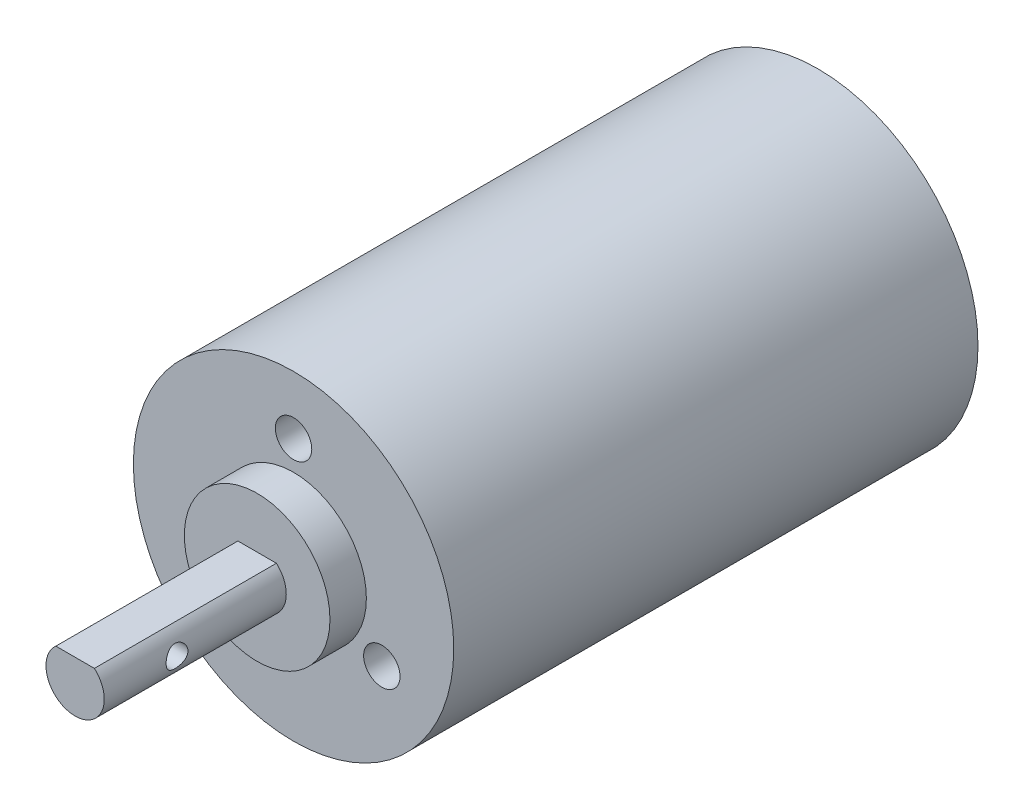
from build123d import *

# Parameters (mm, degrees)
SKETCH1_R               = 11
BASE_EXTRUDE_DEPTH      = 36
BOSS_EXTRUDE1_DEPTH     = 15
SKETCH3_R               = 1
CUT_EXTRUDE1_DEPTH      = 6.5
SKETCH4_R               = 1.25
CUT_EXTRUDE2_DEPTH      = 4
CIRPATTERN1_COUNT       = 3
SKETCH5_R               = 5
BOSS_EXTRUDE2_DEPTH     = 2.5
CUT_EXTRUDE3_DEPTH      = 40.217343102
CUT_EXTRUDE3_DEPTH_BACK = 40.217343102
SKETCH6_R               = 0.75


with BuildPart() as part:
    # Sketch1 → Base-Extrude (new body)
    with BuildSketch(Plane.XY):
        Circle(SKETCH1_R)
    extrude(amount=-BASE_EXTRUDE_DEPTH)

    # Sketch2 → Boss-Extrude1 (add)
    with BuildSketch(Plane.XY):
        with BuildLine():
            Line((-1.322875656, 1.5), (1.322875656, 1.5))
            ThreePointArc((1.322875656, 1.5), (0, -2), (-1.322875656, 1.5))
        make_face()
    extrude(amount=BOSS_EXTRUDE1_DEPTH)

    # Sketch3 → Cut-Extrude1 (cut)
    with BuildSketch(Plane(origin=(0, 0, -36), x_dir=(-1, 0, 0), z_dir=(0, 0, -1))):
        Circle(SKETCH3_R)
    extrude(amount=-CUT_EXTRUDE1_DEPTH, mode=Mode.SUBTRACT)

    # Sketch4 → Cut-Extrude2 (cut)
    with BuildSketch(Plane.XY):
        with Locations((0, 7)):
            Circle(SKETCH4_R)
    cut_extrude2 = extrude(amount=-CUT_EXTRUDE2_DEPTH, mode=Mode.SUBTRACT)

    # CirPattern1: Cut-Extrude2 ×3 about axis
    cirpattern1_axis = Axis((0, 0, 0), (0, 0, 1))
    for i in range(1, CIRPATTERN1_COUNT):
        add(cut_extrude2.rotate(cirpattern1_axis, i * 360 / CIRPATTERN1_COUNT), mode=Mode.SUBTRACT)

    # Sketch5 → Boss-Extrude2 (add)
    with BuildSketch(Plane.XY):
        Circle(SKETCH5_R)
    extrude(amount=BOSS_EXTRUDE2_DEPTH)

    # Sketch6 → Cut-Extrude3 (cut, two sides: drawn at the far end of the back side and taken through both)
    with BuildSketch(Plane(origin=(0, 0, 0), x_dir=(0, 0, -1), z_dir=(1, 0, 0)).offset(-CUT_EXTRUDE3_DEPTH_BACK)):
        with Locations((-10, 0)):
            Circle(SKETCH6_R)
    extrude(amount=CUT_EXTRUDE3_DEPTH + CUT_EXTRUDE3_DEPTH_BACK, mode=Mode.SUBTRACT)


solid = part.part
